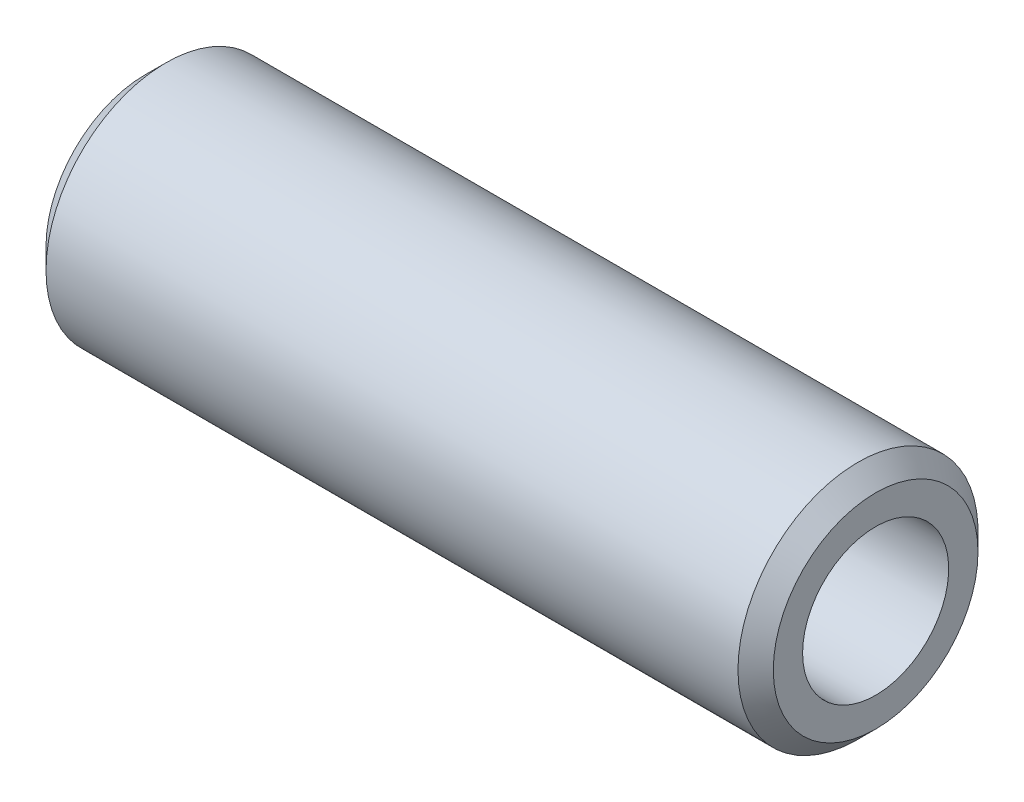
from build123d import *


with BuildPart() as part:
    # Esquisse1 → R_volution1 (revolve)
    with BuildSketch(Plane.XY, mode=Mode.PRIVATE) as r_volution1_sk:
        Polygon((-28.789130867, 3.354788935), (-29.635384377, 4.201042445), (-62.789130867, 4.201042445), (-63.789130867, 3.201042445), (-63.789130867, 1.951042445), (-28.789130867, 1.951042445), align=None)
    revolve(r_volution1_sk.sketch.rotate(Axis((-47.142433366, -1.548957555, 0), (1, 0, 0)), 90), axis=Axis((-47.142433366, -1.548957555, 0), (1, 0, 0)))


solid = part.part
